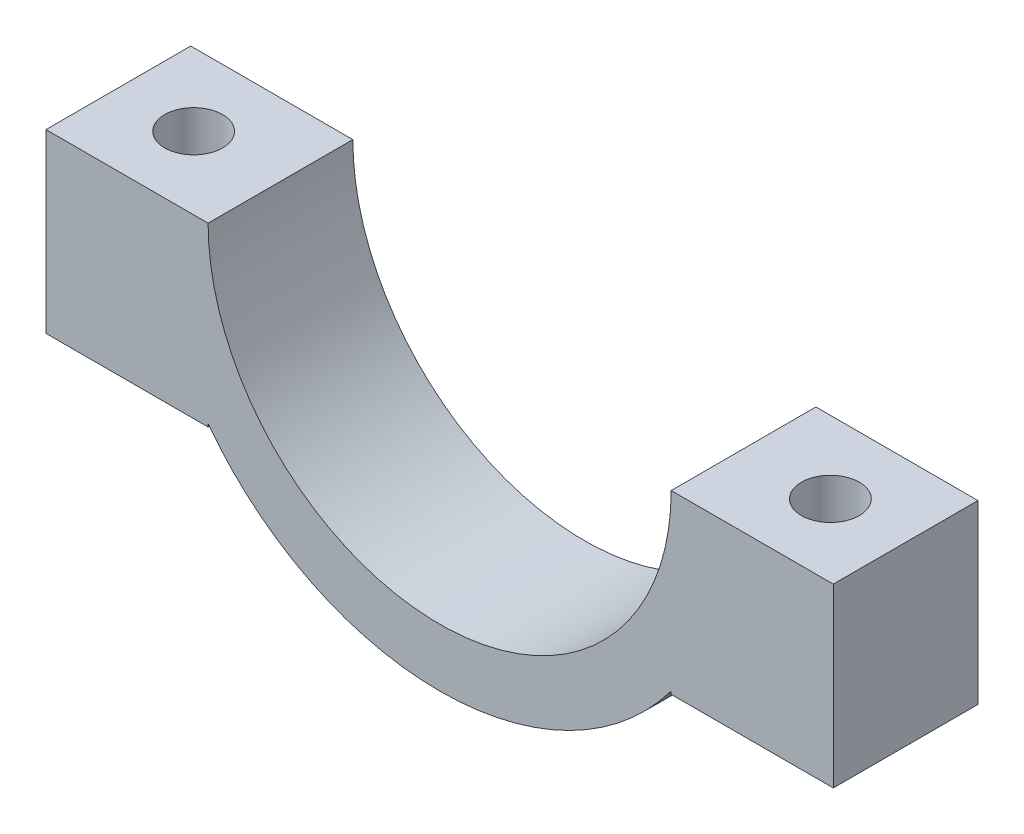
from build123d import *

# Parameters (mm, degrees)
BOSS_EXTRUDE1_DEPTH = 5
SKETCH3_R           = 1
CUT_EXTRUDE1_DEPTH  = 10


with BuildPart() as part:
    # Sketch2 → Boss-Extrude1 (new body)
    with BuildSketch(Plane.XY):
        with BuildLine():
            ThreePointArc((-8, -6), (0, -10), (8, -6))
            Line((8, -6), (8, -6.1))
            Line((8, -6.1), (13.6, -6.1))
            Line((13.6, -6.1), (13.6, 0))
            Line((13.6, 0), (8, 0))
            ThreePointArc((8, 0), (0, -8), (-8, 0))
            Line((-8, 0), (-13.6, 0))
            Line((-13.6, 0), (-13.6, -6.1))
            Line((-13.6, -6.1), (-8, -6.1))
            Line((-8, -6.1), (-8, -6))
        make_face()
    extrude(amount=BOSS_EXTRUDE1_DEPTH)

    # Sketch3 → Cut-Extrude1 (cut)
    with BuildSketch(Plane(origin=(0, 0, 0), x_dir=(1, 0, 0), z_dir=(0, 1, 0))):
        with Locations(Location((-11, -2.5, 0), (0, 0, 180))):
            Circle(SKETCH3_R)
        with Locations(Location((11, -2.5, 0), (0, 0, 180))):
            Circle(SKETCH3_R)
    extrude(amount=-CUT_EXTRUDE1_DEPTH, mode=Mode.SUBTRACT)


solid = part.part
